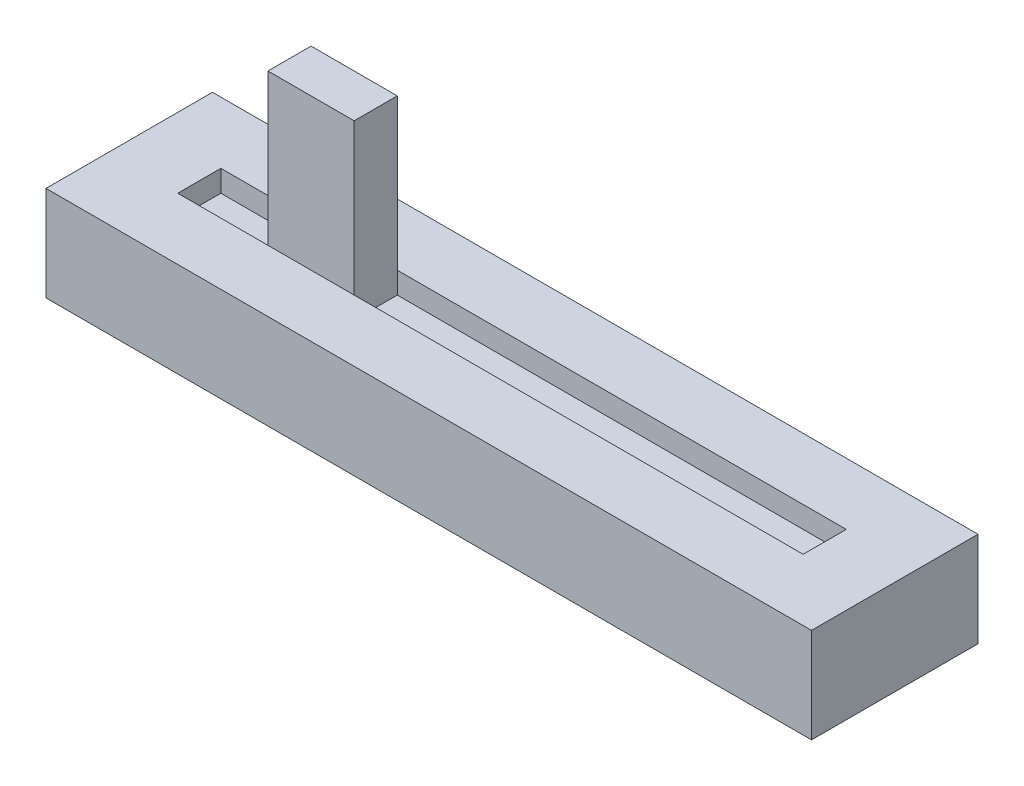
from build123d import *

# Parameters (mm, degrees)
SKETCH1_W           = 45.085
SKETCH1_H           = 9.8044
BOSS_EXTRUDE1_DEPTH = 5.588
SKETCH2_W           = 36.83
SKETCH2_H           = 2.54
CUT_EXTRUDE1_DEPTH  = 1.27
SKETCH3_W           = 5.08
SKETCH3_H           = 2.54
BOSS_EXTRUDE2_DEPTH = 10.16


with BuildPart() as part:
    # Sketch1 → Boss-Extrude1 (new body)
    with BuildSketch(Plane(origin=(0, 0, 0), x_dir=(1, 0, 0), z_dir=(0, 1, 0))):
        Rectangle(SKETCH1_W, SKETCH1_H)
    extrude(amount=BOSS_EXTRUDE1_DEPTH)

    # Sketch2 → Cut-Extrude1 (cut)
    with BuildSketch(Plane(origin=(0, 5.588, 0), x_dir=(1, 0, 0), z_dir=(0, 1, 0))):
        Rectangle(SKETCH2_W, SKETCH2_H)
    extrude(amount=-CUT_EXTRUDE1_DEPTH, mode=Mode.SUBTRACT)

    # Sketch3 → Boss-Extrude2 (add)
    with BuildSketch(Plane(origin=(0, 4.318, 0), x_dir=(1, 0, 0), z_dir=(0, 1, 0))):
        with Locations((-10.56575435, 0)):
            Rectangle(SKETCH3_W, SKETCH3_H)
    extrude(amount=BOSS_EXTRUDE2_DEPTH)


solid = part.part
